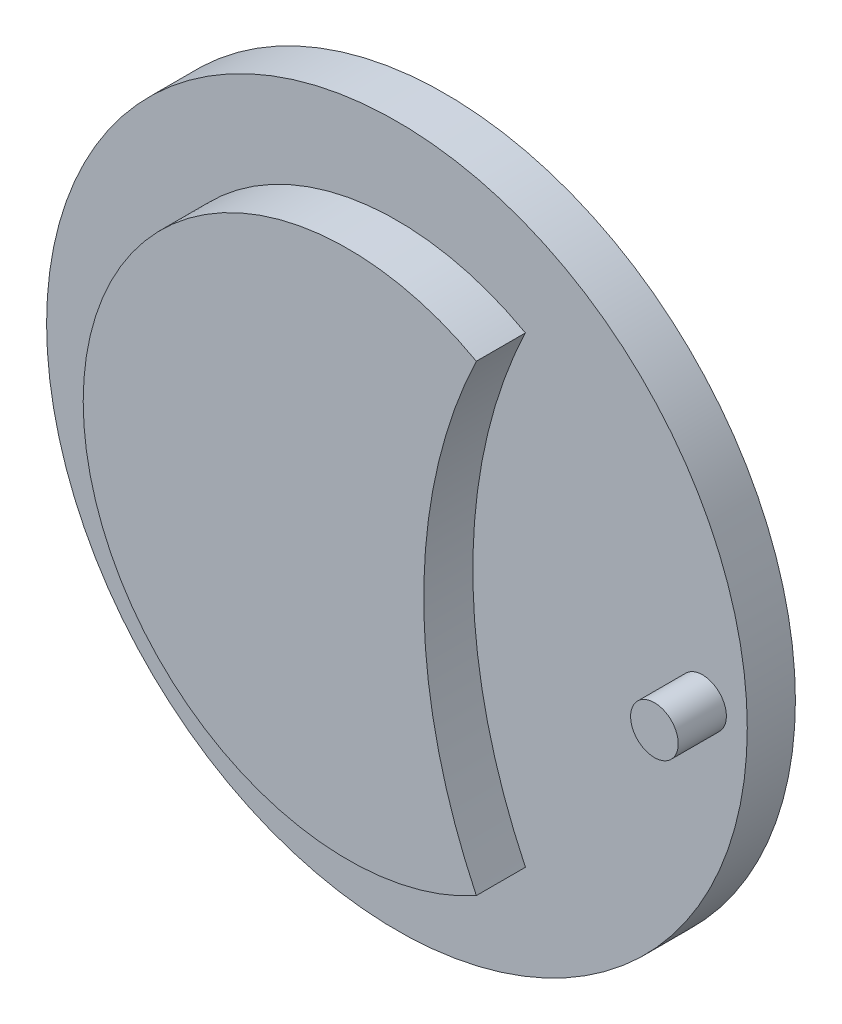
from build123d import *

# Parameters (mm, degrees)
SKETCH1_R           = 69.85
BASE_EXTRUDE_DEPTH  = 12.954
SKETCH2_R           = 92.464672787
BOSS_EXTRUDE1_DEPTH = 12.7
SKETCH3_R           = 6.2865
BOSS_EXTRUDE2_DEPTH = 12.7
CUT_EXTRUDE1_START  = -12.954
CUT_EXTRUDE1_DEPTH  = 12.954


with BuildPart() as part:
    # Sketch1 → Base-Extrude (new body)
    with BuildSketch(Plane.XY):
        Circle(SKETCH1_R)
    extrude(amount=BASE_EXTRUDE_DEPTH)

    # Sketch2 → Boss-Extrude1 (add)
    with BuildSketch(Plane(origin=(0, 0, 0), x_dir=(-1, 0, 0), z_dir=(0, 0, -1))):
        Circle(SKETCH2_R)
    extrude(amount=BOSS_EXTRUDE1_DEPTH)

    # Sketch3 → Boss-Extrude2 (add)
    with BuildSketch(Plane.XY):
        with Locations(Location((80.655732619, 0, 0), (0, 0, 180))):
            Circle(SKETCH3_R)
    extrude(amount=BOSS_EXTRUDE2_DEPTH)

    # Sketch4 → Cut-Extrude1 (cut)
    with BuildSketch(Plane.XY.offset(12.954).offset(CUT_EXTRUDE1_START)):
        with BuildLine():
            ThreePointArc((33.907249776, 61.068166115), (20.0279, 0), (33.907249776, -61.068166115))
            ThreePointArc((33.907249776, -61.068166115), (69.85, 0), (33.907249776, 61.068166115))
        make_face()
    extrude(amount=CUT_EXTRUDE1_DEPTH, mode=Mode.SUBTRACT)


solid = part.part
